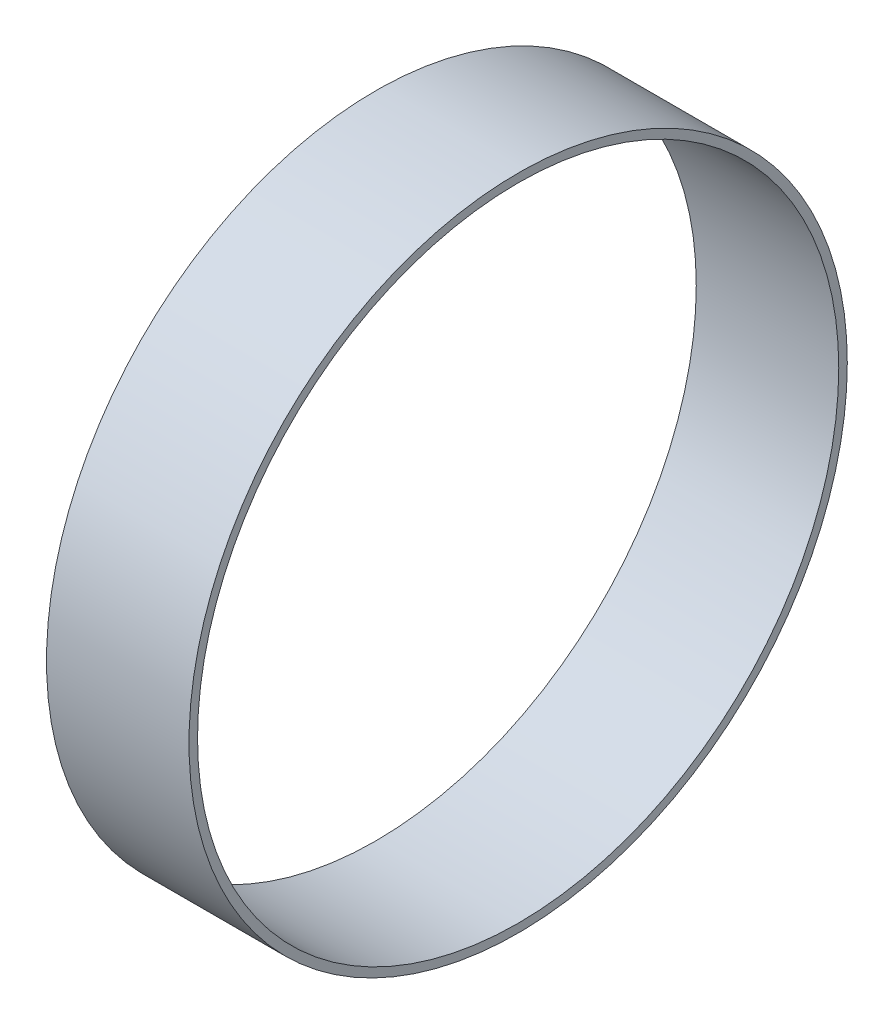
from build123d import *

# Parameters (mm, degrees)
SKETCH_4_R      = 23.1
SKETCH_4_R_2    = 22.5
EXTRUDE_1_DEPTH = 10


with BuildPart() as part:
    # Sketch 4 → Extrude 1 (new body)
    with BuildSketch(Plane(origin=(0, 0, 0), x_dir=(0, 0, -1), z_dir=(1, 0, 0))):
        Circle(SKETCH_4_R)
        Circle(SKETCH_4_R_2, mode=Mode.SUBTRACT)
    extrude(amount=EXTRUDE_1_DEPTH)


solid = part.part
